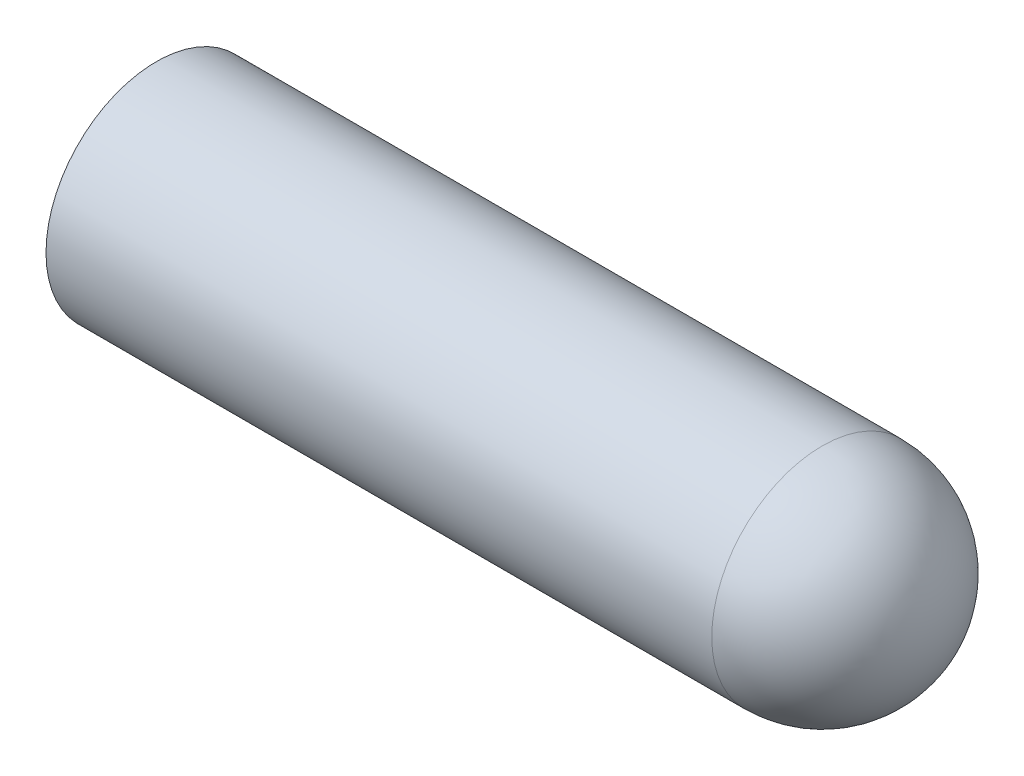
ISO-10303-21;
HEADER;
FILE_DESCRIPTION(('STEP AP214'),'2;1');
FILE_NAME('part.step','',(''),(''),'','','');
FILE_SCHEMA(('AUTOMOTIVE_DESIGN { 1 0 10303 214 1 1 1 1 }'));
ENDSEC;
DATA;
#1=APPLICATION_CONTEXT('core data for automotive mechanical design processes');
#2=APPLICATION_PROTOCOL_DEFINITION('international standard','automotive_design',2000,#1);
#3=PRODUCT_CONTEXT('',#1,'mechanical');
#4=PRODUCT('Part','Part','',(#3));
#5=PRODUCT_RELATED_PRODUCT_CATEGORY('part','',(#4));
#6=PRODUCT_DEFINITION_FORMATION('','',#4);
#7=PRODUCT_DEFINITION_CONTEXT('part definition',#1,'design');
#8=PRODUCT_DEFINITION('design','',#6,#7);
#9=PRODUCT_DEFINITION_SHAPE('','',#8);
#10=(LENGTH_UNIT() NAMED_UNIT(*) SI_UNIT(.MILLI.,.METRE.));
#11=(NAMED_UNIT(*) PLANE_ANGLE_UNIT() SI_UNIT($,.RADIAN.));
#12=(NAMED_UNIT(*) SI_UNIT($,.STERADIAN.) SOLID_ANGLE_UNIT());
#13=UNCERTAINTY_MEASURE_WITH_UNIT(LENGTH_MEASURE(1.E-05),#10,'distance_accuracy_value','');
#14=(GEOMETRIC_REPRESENTATION_CONTEXT(3) GLOBAL_UNCERTAINTY_ASSIGNED_CONTEXT((#13)) GLOBAL_UNIT_ASSIGNED_CONTEXT((#10,
#11,#12)) REPRESENTATION_CONTEXT('',''));
#15=CARTESIAN_POINT('',(0.,0.,0.));
#16=DIRECTION('',(0.,0.,1.));
#17=DIRECTION('',(1.,0.,0.));
#18=AXIS2_PLACEMENT_3D('',#15,#16,#17);
#19=CARTESIAN_POINT('',(-27.25,0.,0.));
#20=DIRECTION('',(1.,0.,0.));
#21=DIRECTION('',(0.,0.,-1.));
#22=AXIS2_PLACEMENT_3D('',#19,#20,#21);
#23=PLANE('',#22);
#24=CARTESIAN_POINT('',(-27.25,0.,0.));
#25=DIRECTION('',(-1.,0.,0.));
#26=DIRECTION('',(0.,0.,1.));
#27=AXIS2_PLACEMENT_3D('',#24,#25,#26);
#28=CIRCLE('',#27,7.75);
#29=CARTESIAN_POINT('',(-27.25,0.,7.75));
#30=VERTEX_POINT('',#29);
#31=EDGE_CURVE('E10',#30,#30,#28,.T.);
#32=ORIENTED_EDGE('',*,*,#31,.T.);
#33=EDGE_LOOP('',(#32));
#34=FACE_BOUND('',#33,.T.);
#35=CARTESIAN_POINT('',(-27.25,0.,0.));
#36=DIRECTION('',(1.,0.,0.));
#37=DIRECTION('',(0.,0.,-1.));
#38=AXIS2_PLACEMENT_3D('',#35,#36,#37);
#39=CIRCLE('',#38,6.95);
#40=CARTESIAN_POINT('',(-27.25,0.,-6.95));
#41=VERTEX_POINT('',#40);
#42=EDGE_CURVE('E40',#41,#41,#39,.F.);
#43=ORIENTED_EDGE('',*,*,#42,.F.);
#44=EDGE_LOOP('',(#43));
#45=FACE_BOUND('',#44,.T.);
#46=ADVANCED_FACE('F30',(#34,#45),#23,.F.);
#47=CARTESIAN_POINT('',(-27.25,0.,0.));
#48=DIRECTION('',(-1.,0.,0.));
#49=DIRECTION('',(0.,0.,1.));
#50=AXIS2_PLACEMENT_3D('',#47,#48,#49);
#51=CYLINDRICAL_SURFACE('',#50,7.75);
#52=ORIENTED_EDGE('',*,*,#31,.F.);
#53=EDGE_LOOP('',(#52));
#54=FACE_BOUND('',#53,.T.);
#55=CARTESIAN_POINT('',(19.5,0.,0.));
#56=DIRECTION('',(-1.,0.,0.));
#57=DIRECTION('',(0.,0.,1.));
#58=AXIS2_PLACEMENT_3D('',#55,#56,#57);
#59=CIRCLE('',#58,7.75);
#60=CARTESIAN_POINT('',(19.5,0.,7.75));
#61=VERTEX_POINT('',#60);
#62=EDGE_CURVE('E36',#61,#61,#59,.T.);
#63=ORIENTED_EDGE('',*,*,#62,.T.);
#64=EDGE_LOOP('',(#63));
#65=FACE_BOUND('',#64,.T.);
#66=ADVANCED_FACE('F62',(#54,#65),#51,.T.);
#67=CARTESIAN_POINT('',(19.5,0.,0.));
#68=DIRECTION('',(-1.,0.,0.));
#69=DIRECTION('',(0.,1.,0.));
#70=AXIS2_PLACEMENT_3D('',#67,#68,#69);
#71=SPHERICAL_SURFACE('',#70,7.75);
#72=ORIENTED_EDGE('',*,*,#62,.F.);
#73=EDGE_LOOP('',(#72));
#74=FACE_BOUND('',#73,.T.);
#75=ADVANCED_FACE('F54',(#74),#71,.T.);
#76=CARTESIAN_POINT('',(-27.25,0.,0.));
#77=DIRECTION('',(-1.,0.,0.));
#78=DIRECTION('',(0.,0.,1.));
#79=AXIS2_PLACEMENT_3D('',#76,#77,#78);
#80=CYLINDRICAL_SURFACE('',#79,6.95);
#81=ORIENTED_EDGE('',*,*,#42,.T.);
#82=EDGE_LOOP('',(#81));
#83=FACE_BOUND('',#82,.T.);
#84=CARTESIAN_POINT('',(19.5,0.,0.));
#85=DIRECTION('',(-1.,0.,0.));
#86=DIRECTION('',(0.,0.,1.));
#87=AXIS2_PLACEMENT_3D('',#84,#85,#86);
#88=CIRCLE('',#87,6.95);
#89=CARTESIAN_POINT('',(19.5,0.,6.95));
#90=VERTEX_POINT('',#89);
#91=EDGE_CURVE('E44',#90,#90,#88,.T.);
#92=ORIENTED_EDGE('',*,*,#91,.F.);
#93=EDGE_LOOP('',(#92));
#94=FACE_BOUND('',#93,.T.);
#95=ADVANCED_FACE('F52',(#83,#94),#80,.F.);
#96=CARTESIAN_POINT('',(19.5,0.,0.));
#97=DIRECTION('',(-1.,0.,0.));
#98=DIRECTION('',(0.,1.,0.));
#99=AXIS2_PLACEMENT_3D('',#96,#97,#98);
#100=SPHERICAL_SURFACE('',#99,6.95);
#101=ORIENTED_EDGE('',*,*,#91,.T.);
#102=EDGE_LOOP('',(#101));
#103=FACE_BOUND('',#102,.T.);
#104=ADVANCED_FACE('F50',(#103),#100,.F.);
#105=CLOSED_SHELL('',(#46,#66,#75,#95,#104));
#106=MANIFOLD_SOLID_BREP('B2',#105);
#107=ADVANCED_BREP_SHAPE_REPRESENTATION('',(#18,#106),#14);
#108=SHAPE_DEFINITION_REPRESENTATION(#9,#107);
ENDSEC;
END-ISO-10303-21;
